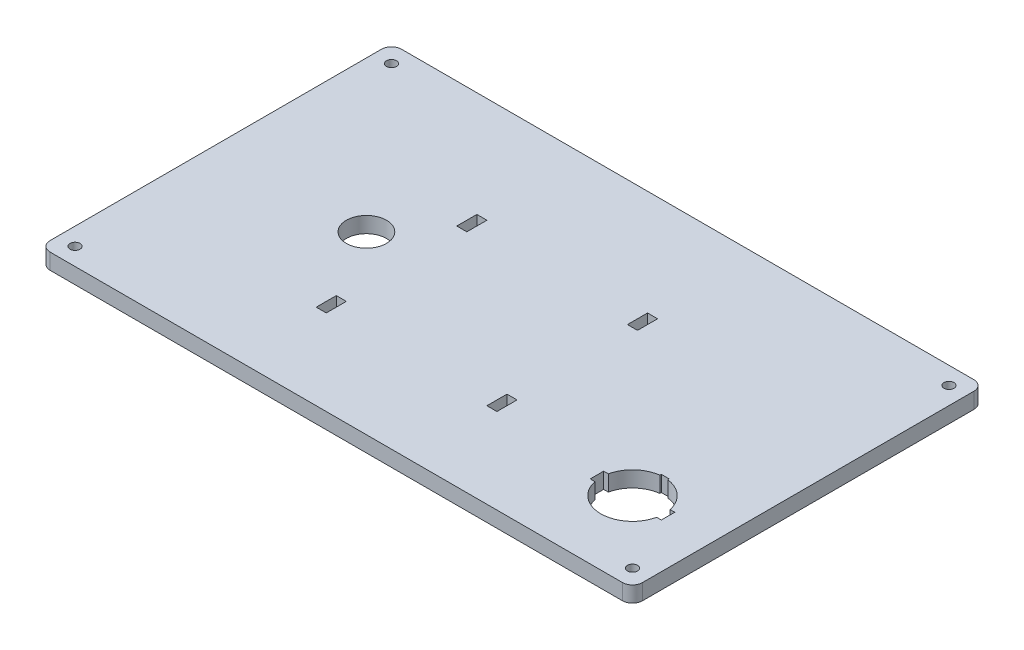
ISO-10303-21;
HEADER;
FILE_DESCRIPTION(('STEP AP214'),'2;1');
FILE_NAME('part.step','',(''),(''),'','','');
FILE_SCHEMA(('AUTOMOTIVE_DESIGN { 1 0 10303 214 1 1 1 1 }'));
ENDSEC;
DATA;
#1=APPLICATION_CONTEXT('core data for automotive mechanical design processes');
#2=APPLICATION_PROTOCOL_DEFINITION('international standard','automotive_design',2000,#1);
#3=PRODUCT_CONTEXT('',#1,'mechanical');
#4=PRODUCT('Part','Part','',(#3));
#5=PRODUCT_RELATED_PRODUCT_CATEGORY('part','',(#4));
#6=PRODUCT_DEFINITION_FORMATION('','',#4);
#7=PRODUCT_DEFINITION_CONTEXT('part definition',#1,'design');
#8=PRODUCT_DEFINITION('design','',#6,#7);
#9=PRODUCT_DEFINITION_SHAPE('','',#8);
#10=(LENGTH_UNIT() NAMED_UNIT(*) SI_UNIT(.MILLI.,.METRE.));
#11=(NAMED_UNIT(*) PLANE_ANGLE_UNIT() SI_UNIT($,.RADIAN.));
#12=(NAMED_UNIT(*) SI_UNIT($,.STERADIAN.) SOLID_ANGLE_UNIT());
#13=UNCERTAINTY_MEASURE_WITH_UNIT(LENGTH_MEASURE(1.E-05),#10,'distance_accuracy_value','');
#14=(GEOMETRIC_REPRESENTATION_CONTEXT(3) GLOBAL_UNCERTAINTY_ASSIGNED_CONTEXT((#13)) GLOBAL_UNIT_ASSIGNED_CONTEXT((#10,
#11,#12)) REPRESENTATION_CONTEXT('',''));
#15=CARTESIAN_POINT('',(0.,0.,0.));
#16=DIRECTION('',(0.,0.,1.));
#17=DIRECTION('',(1.,0.,0.));
#18=AXIS2_PLACEMENT_3D('',#15,#16,#17);
#19=CARTESIAN_POINT('',(-90.4875,5.,52.3875));
#20=DIRECTION('',(0.,1.,0.));
#21=DIRECTION('',(0.,0.,1.));
#22=AXIS2_PLACEMENT_3D('',#19,#20,#21);
#23=PLANE('',#22);
#24=CARTESIAN_POINT('',(-46.0375,5.,0.));
#25=DIRECTION('',(0.,1.,0.));
#26=DIRECTION('',(0.,0.,1.));
#27=AXIS2_PLACEMENT_3D('',#24,#25,#26);
#28=CIRCLE('',#27,6.35);
#29=CARTESIAN_POINT('',(-46.0375,5.,6.35));
#30=VERTEX_POINT('',#29);
#31=EDGE_CURVE('E753',#30,#30,#28,.T.);
#32=ORIENTED_EDGE('',*,*,#31,.F.);
#33=EDGE_LOOP('',(#32));
#34=FACE_BOUND('',#33,.T.);
#35=CARTESIAN_POINT('',(68.2625,5.,30.1625));
#36=DIRECTION('',(0.,1.,0.));
#37=DIRECTION('',(0.,0.,1.));
#38=AXIS2_PLACEMENT_3D('',#35,#36,#37);
#39=CIRCLE('',#38,9.99998);
#40=CARTESIAN_POINT('',(58.4908467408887,5.,32.28721));
#41=VERTEX_POINT('',#40);
#42=CARTESIAN_POINT('',(78.0341532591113,5.,32.28721));
#43=VERTEX_POINT('',#42);
#44=EDGE_CURVE('E48',#41,#43,#39,.T.);
#45=ORIENTED_EDGE('',*,*,#44,.F.);
#46=DIRECTION('',(1.,0.,0.));
#47=VECTOR('',#46,1.);
#48=CARTESIAN_POINT('',(58.4908467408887,5.,32.28721));
#49=LINE('',#48,#47);
#50=CARTESIAN_POINT('',(57.01284,5.,32.28721));
#51=VERTEX_POINT('',#50);
#52=EDGE_CURVE('E274',#51,#41,#49,.T.);
#53=ORIENTED_EDGE('',*,*,#52,.F.);
#54=DIRECTION('',(0.,0.,1.));
#55=VECTOR('',#54,1.);
#56=CARTESIAN_POINT('',(57.01284,5.,32.28721));
#57=LINE('',#56,#55);
#58=CARTESIAN_POINT('',(57.01284,5.,28.03779));
#59=VERTEX_POINT('',#58);
#60=EDGE_CURVE('E320',#59,#51,#57,.T.);
#61=ORIENTED_EDGE('',*,*,#60,.F.);
#62=DIRECTION('',(-1.,0.,0.));
#63=VECTOR('',#62,1.);
#64=CARTESIAN_POINT('',(57.01284,5.,28.03779));
#65=LINE('',#64,#63);
#66=CARTESIAN_POINT('',(58.4908467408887,5.,28.03779));
#67=VERTEX_POINT('',#66);
#68=EDGE_CURVE('E317',#67,#59,#65,.T.);
#69=ORIENTED_EDGE('',*,*,#68,.F.);
#70=CARTESIAN_POINT('',(68.2625,5.,30.1625));
#71=DIRECTION('',(0.,1.,0.));
#72=DIRECTION('',(0.,0.,1.));
#73=AXIS2_PLACEMENT_3D('',#70,#71,#72);
#74=CIRCLE('',#73,9.99998);
#75=CARTESIAN_POINT('',(67.01282,5.,20.2409124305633));
#76=VERTEX_POINT('',#75);
#77=EDGE_CURVE('E314',#76,#67,#74,.T.);
#78=ORIENTED_EDGE('',*,*,#77,.F.);
#79=DIRECTION('',(0.,0.,1.));
#80=VECTOR('',#79,1.);
#81=CARTESIAN_POINT('',(67.01282,5.,19.7866));
#82=LINE('',#81,#80);
#83=CARTESIAN_POINT('',(67.01282,5.,19.7866));
#84=VERTEX_POINT('',#83);
#85=EDGE_CURVE('E311',#84,#76,#82,.T.);
#86=ORIENTED_EDGE('',*,*,#85,.F.);
#87=DIRECTION('',(-1.,0.,0.));
#88=VECTOR('',#87,1.);
#89=CARTESIAN_POINT('',(69.51218,5.,19.7866));
#90=LINE('',#89,#88);
#91=CARTESIAN_POINT('',(69.51218,5.,19.7866));
#92=VERTEX_POINT('',#91);
#93=EDGE_CURVE('E308',#92,#84,#90,.T.);
#94=ORIENTED_EDGE('',*,*,#93,.F.);
#95=DIRECTION('',(0.,0.,-1.));
#96=VECTOR('',#95,1.);
#97=CARTESIAN_POINT('',(69.51218,5.,19.7866));
#98=LINE('',#97,#96);
#99=CARTESIAN_POINT('',(69.51218,5.,20.2409124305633));
#100=VERTEX_POINT('',#99);
#101=EDGE_CURVE('E305',#100,#92,#98,.T.);
#102=ORIENTED_EDGE('',*,*,#101,.F.);
#103=CARTESIAN_POINT('',(68.2625,5.,30.1625));
#104=DIRECTION('',(0.,1.,0.));
#105=DIRECTION('',(0.,0.,1.));
#106=AXIS2_PLACEMENT_3D('',#103,#104,#105);
#107=CIRCLE('',#106,9.99998);
#108=CARTESIAN_POINT('',(78.0341532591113,5.,28.03779));
#109=VERTEX_POINT('',#108);
#110=EDGE_CURVE('E302',#109,#100,#107,.T.);
#111=ORIENTED_EDGE('',*,*,#110,.F.);
#112=DIRECTION('',(-1.,0.,0.));
#113=VECTOR('',#112,1.);
#114=CARTESIAN_POINT('',(79.51216,5.,28.03779));
#115=LINE('',#114,#113);
#116=CARTESIAN_POINT('',(79.51216,5.,28.03779));
#117=VERTEX_POINT('',#116);
#118=EDGE_CURVE('E299',#117,#109,#115,.T.);
#119=ORIENTED_EDGE('',*,*,#118,.F.);
#120=DIRECTION('',(0.,0.,-1.));
#121=VECTOR('',#120,1.);
#122=CARTESIAN_POINT('',(79.51216,5.,32.28721));
#123=LINE('',#122,#121);
#124=CARTESIAN_POINT('',(79.51216,5.,32.28721));
#125=VERTEX_POINT('',#124);
#126=EDGE_CURVE('E296',#125,#117,#123,.T.);
#127=ORIENTED_EDGE('',*,*,#126,.F.);
#128=DIRECTION('',(1.,0.,0.));
#129=VECTOR('',#128,1.);
#130=CARTESIAN_POINT('',(78.0341532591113,5.,32.28721));
#131=LINE('',#130,#129);
#132=EDGE_CURVE('E289',#43,#125,#131,.T.);
#133=ORIENTED_EDGE('',*,*,#132,.F.);
#134=EDGE_LOOP('',(#45,#53,#61,#69,#78,#86,#94,#102,#111,#119,#127,#133));
#135=FACE_BOUND('',#134,.T.);
#136=DIRECTION('',(0.,0.,1.));
#137=VECTOR('',#136,1.);
#138=CARTESIAN_POINT('',(-33.3375,5.,22.225));
#139=LINE('',#138,#137);
#140=CARTESIAN_POINT('',(-33.3375,5.,22.225));
#141=VERTEX_POINT('',#140);
#142=CARTESIAN_POINT('',(-33.3375,5.,28.575));
#143=VERTEX_POINT('',#142);
#144=EDGE_CURVE('E352',#141,#143,#139,.T.);
#145=ORIENTED_EDGE('',*,*,#144,.F.);
#146=DIRECTION('',(-1.,0.,0.));
#147=VECTOR('',#146,1.);
#148=CARTESIAN_POINT('',(-33.3375,5.,22.225));
#149=LINE('',#148,#147);
#150=CARTESIAN_POINT('',(-30.1625,5.,22.225));
#151=VERTEX_POINT('',#150);
#152=EDGE_CURVE('E360',#151,#141,#149,.T.);
#153=ORIENTED_EDGE('',*,*,#152,.F.);
#154=DIRECTION('',(0.,0.,-1.));
#155=VECTOR('',#154,1.);
#156=CARTESIAN_POINT('',(-30.1625,5.,22.225));
#157=LINE('',#156,#155);
#158=CARTESIAN_POINT('',(-30.1625,5.,28.575));
#159=VERTEX_POINT('',#158);
#160=EDGE_CURVE('E357',#159,#151,#157,.T.);
#161=ORIENTED_EDGE('',*,*,#160,.F.);
#162=DIRECTION('',(1.,0.,0.));
#163=VECTOR('',#162,1.);
#164=CARTESIAN_POINT('',(-33.3375,5.,28.575));
#165=LINE('',#164,#163);
#166=EDGE_CURVE('E354',#143,#159,#165,.T.);
#167=ORIENTED_EDGE('',*,*,#166,.F.);
#168=EDGE_LOOP('',(#145,#153,#161,#167));
#169=FACE_BOUND('',#168,.T.);
#170=DIRECTION('',(0.,0.,1.));
#171=VECTOR('',#170,1.);
#172=CARTESIAN_POINT('',(-33.3375,5.,-22.225));
#173=LINE('',#172,#171);
#174=CARTESIAN_POINT('',(-33.3375,5.,-22.225));
#175=VERTEX_POINT('',#174);
#176=CARTESIAN_POINT('',(-33.3375,5.,-15.875));
#177=VERTEX_POINT('',#176);
#178=EDGE_CURVE('E383',#175,#177,#173,.T.);
#179=ORIENTED_EDGE('',*,*,#178,.F.);
#180=DIRECTION('',(-1.,0.,0.));
#181=VECTOR('',#180,1.);
#182=CARTESIAN_POINT('',(-33.3375,5.,-22.225));
#183=LINE('',#182,#181);
#184=CARTESIAN_POINT('',(-30.1625,5.,-22.225));
#185=VERTEX_POINT('',#184);
#186=EDGE_CURVE('E391',#185,#175,#183,.T.);
#187=ORIENTED_EDGE('',*,*,#186,.F.);
#188=DIRECTION('',(0.,0.,-1.));
#189=VECTOR('',#188,1.);
#190=CARTESIAN_POINT('',(-30.1625,5.,-22.225));
#191=LINE('',#190,#189);
#192=CARTESIAN_POINT('',(-30.1625,5.,-15.875));
#193=VERTEX_POINT('',#192);
#194=EDGE_CURVE('E388',#193,#185,#191,.T.);
#195=ORIENTED_EDGE('',*,*,#194,.F.);
#196=DIRECTION('',(1.,0.,0.));
#197=VECTOR('',#196,1.);
#198=CARTESIAN_POINT('',(-33.3375,5.,-15.875));
#199=LINE('',#198,#197);
#200=EDGE_CURVE('E385',#177,#193,#199,.T.);
#201=ORIENTED_EDGE('',*,*,#200,.F.);
#202=EDGE_LOOP('',(#179,#187,#195,#201));
#203=FACE_BOUND('',#202,.T.);
#204=DIRECTION('',(0.,0.,1.));
#205=VECTOR('',#204,1.);
#206=CARTESIAN_POINT('',(20.6375,5.,-22.225));
#207=LINE('',#206,#205);
#208=CARTESIAN_POINT('',(20.6375,5.,-22.225));
#209=VERTEX_POINT('',#208);
#210=CARTESIAN_POINT('',(20.6375,5.,-15.875));
#211=VERTEX_POINT('',#210);
#212=EDGE_CURVE('E414',#209,#211,#207,.T.);
#213=ORIENTED_EDGE('',*,*,#212,.F.);
#214=DIRECTION('',(-1.,0.,0.));
#215=VECTOR('',#214,1.);
#216=CARTESIAN_POINT('',(20.6375,5.,-22.225));
#217=LINE('',#216,#215);
#218=CARTESIAN_POINT('',(23.8125,5.,-22.225));
#219=VERTEX_POINT('',#218);
#220=EDGE_CURVE('E422',#219,#209,#217,.T.);
#221=ORIENTED_EDGE('',*,*,#220,.F.);
#222=DIRECTION('',(0.,0.,-1.));
#223=VECTOR('',#222,1.);
#224=CARTESIAN_POINT('',(23.8125,5.,-22.225));
#225=LINE('',#224,#223);
#226=CARTESIAN_POINT('',(23.8125,5.,-15.875));
#227=VERTEX_POINT('',#226);
#228=EDGE_CURVE('E419',#227,#219,#225,.T.);
#229=ORIENTED_EDGE('',*,*,#228,.F.);
#230=DIRECTION('',(1.,0.,0.));
#231=VECTOR('',#230,1.);
#232=CARTESIAN_POINT('',(20.6375,5.,-15.875));
#233=LINE('',#232,#231);
#234=EDGE_CURVE('E416',#211,#227,#233,.T.);
#235=ORIENTED_EDGE('',*,*,#234,.F.);
#236=EDGE_LOOP('',(#213,#221,#229,#235));
#237=FACE_BOUND('',#236,.T.);
#238=DIRECTION('',(0.,0.,1.));
#239=VECTOR('',#238,1.);
#240=CARTESIAN_POINT('',(20.6375,5.,22.225));
#241=LINE('',#240,#239);
#242=CARTESIAN_POINT('',(20.6375,5.,22.225));
#243=VERTEX_POINT('',#242);
#244=CARTESIAN_POINT('',(20.6375,5.,28.575));
#245=VERTEX_POINT('',#244);
#246=EDGE_CURVE('E445',#243,#245,#241,.T.);
#247=ORIENTED_EDGE('',*,*,#246,.F.);
#248=DIRECTION('',(-1.,0.,0.));
#249=VECTOR('',#248,1.);
#250=CARTESIAN_POINT('',(20.6375,5.,22.225));
#251=LINE('',#250,#249);
#252=CARTESIAN_POINT('',(23.8125,5.,22.225));
#253=VERTEX_POINT('',#252);
#254=EDGE_CURVE('E453',#253,#243,#251,.T.);
#255=ORIENTED_EDGE('',*,*,#254,.F.);
#256=DIRECTION('',(0.,0.,-1.));
#257=VECTOR('',#256,1.);
#258=CARTESIAN_POINT('',(23.8125,5.,22.225));
#259=LINE('',#258,#257);
#260=CARTESIAN_POINT('',(23.8125,5.,28.575));
#261=VERTEX_POINT('',#260);
#262=EDGE_CURVE('E450',#261,#253,#259,.T.);
#263=ORIENTED_EDGE('',*,*,#262,.F.);
#264=DIRECTION('',(1.,0.,0.));
#265=VECTOR('',#264,1.);
#266=CARTESIAN_POINT('',(20.6375,5.,28.575));
#267=LINE('',#266,#265);
#268=EDGE_CURVE('E447',#245,#261,#267,.T.);
#269=ORIENTED_EDGE('',*,*,#268,.F.);
#270=EDGE_LOOP('',(#247,#255,#263,#269));
#271=FACE_BOUND('',#270,.T.);
#272=CARTESIAN_POINT('',(88.138,5.,50.038));
#273=DIRECTION('',(0.,1.,0.));
#274=DIRECTION('',(0.,0.,1.));
#275=AXIS2_PLACEMENT_3D('',#272,#273,#274);
#276=CIRCLE('',#275,1.5875);
#277=CARTESIAN_POINT('',(88.138,5.,51.6255));
#278=VERTEX_POINT('',#277);
#279=EDGE_CURVE('E475',#278,#278,#276,.T.);
#280=ORIENTED_EDGE('',*,*,#279,.F.);
#281=EDGE_LOOP('',(#280));
#282=FACE_BOUND('',#281,.T.);
#283=CARTESIAN_POINT('',(-88.138,5.,-50.038));
#284=DIRECTION('',(0.,1.,0.));
#285=DIRECTION('',(0.,0.,1.));
#286=AXIS2_PLACEMENT_3D('',#283,#284,#285);
#287=CIRCLE('',#286,1.5875);
#288=CARTESIAN_POINT('',(-88.138,5.,-48.4505));
#289=VERTEX_POINT('',#288);
#290=EDGE_CURVE('E487',#289,#289,#287,.T.);
#291=ORIENTED_EDGE('',*,*,#290,.F.);
#292=EDGE_LOOP('',(#291));
#293=FACE_BOUND('',#292,.T.);
#294=CARTESIAN_POINT('',(-90.4875,5.,52.3875));
#295=DIRECTION('',(0.,1.,0.));
#296=DIRECTION('',(0.,0.,1.));
#297=AXIS2_PLACEMENT_3D('',#294,#295,#296);
#298=CIRCLE('',#297,3.175);
#299=CARTESIAN_POINT('',(-93.6625,5.,52.3875));
#300=VERTEX_POINT('',#299);
#301=CARTESIAN_POINT('',(-90.4875,5.,55.5625));
#302=VERTEX_POINT('',#301);
#303=EDGE_CURVE('E493',#300,#302,#298,.T.);
#304=ORIENTED_EDGE('',*,*,#303,.T.);
#305=DIRECTION('',(1.,0.,0.));
#306=VECTOR('',#305,1.);
#307=CARTESIAN_POINT('',(-90.4875,5.,55.5625));
#308=LINE('',#307,#306);
#309=CARTESIAN_POINT('',(90.4875,5.,55.5625));
#310=VERTEX_POINT('',#309);
#311=EDGE_CURVE('E496',#302,#310,#308,.T.);
#312=ORIENTED_EDGE('',*,*,#311,.T.);
#313=CARTESIAN_POINT('',(90.4875,5.,52.3875));
#314=DIRECTION('',(0.,1.,0.));
#315=DIRECTION('',(0.,0.,1.));
#316=AXIS2_PLACEMENT_3D('',#313,#314,#315);
#317=CIRCLE('',#316,3.175);
#318=CARTESIAN_POINT('',(93.6625,5.,52.3875));
#319=VERTEX_POINT('',#318);
#320=EDGE_CURVE('E499',#310,#319,#317,.T.);
#321=ORIENTED_EDGE('',*,*,#320,.T.);
#322=DIRECTION('',(0.,0.,-1.));
#323=VECTOR('',#322,1.);
#324=CARTESIAN_POINT('',(93.6625,5.,-52.3875));
#325=LINE('',#324,#323);
#326=CARTESIAN_POINT('',(93.6625,5.,-52.3875));
#327=VERTEX_POINT('',#326);
#328=EDGE_CURVE('E501',#319,#327,#325,.T.);
#329=ORIENTED_EDGE('',*,*,#328,.T.);
#330=CARTESIAN_POINT('',(90.4875,5.,-52.3875));
#331=DIRECTION('',(0.,1.,0.));
#332=DIRECTION('',(0.,0.,-1.));
#333=AXIS2_PLACEMENT_3D('',#330,#331,#332);
#334=CIRCLE('',#333,3.175);
#335=CARTESIAN_POINT('',(90.4874999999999,5.,-55.5625));
#336=VERTEX_POINT('',#335);
#337=EDGE_CURVE('E503',#327,#336,#334,.T.);
#338=ORIENTED_EDGE('',*,*,#337,.T.);
#339=DIRECTION('',(-1.,0.,0.));
#340=VECTOR('',#339,1.);
#341=CARTESIAN_POINT('',(-90.4875,5.,-55.5625));
#342=LINE('',#341,#340);
#343=CARTESIAN_POINT('',(-90.4875,5.,-55.5625));
#344=VERTEX_POINT('',#343);
#345=EDGE_CURVE('E505',#336,#344,#342,.T.);
#346=ORIENTED_EDGE('',*,*,#345,.T.);
#347=CARTESIAN_POINT('',(-90.4875,5.,-52.3875));
#348=DIRECTION('',(0.,1.,0.));
#349=DIRECTION('',(0.,0.,1.));
#350=AXIS2_PLACEMENT_3D('',#347,#348,#349);
#351=CIRCLE('',#350,3.175);
#352=CARTESIAN_POINT('',(-93.6625,5.,-52.3875));
#353=VERTEX_POINT('',#352);
#354=EDGE_CURVE('E507',#344,#353,#351,.T.);
#355=ORIENTED_EDGE('',*,*,#354,.T.);
#356=DIRECTION('',(0.,0.,1.));
#357=VECTOR('',#356,1.);
#358=CARTESIAN_POINT('',(-93.6625,5.,-52.3875));
#359=LINE('',#358,#357);
#360=EDGE_CURVE('E509',#353,#300,#359,.T.);
#361=ORIENTED_EDGE('',*,*,#360,.T.);
#362=EDGE_LOOP('',(#304,#312,#321,#329,#338,#346,#355,#361));
#363=FACE_BOUND('',#362,.T.);
#364=CARTESIAN_POINT('',(-88.138,5.,50.038));
#365=DIRECTION('',(0.,1.,0.));
#366=DIRECTION('',(0.,0.,1.));
#367=AXIS2_PLACEMENT_3D('',#364,#365,#366);
#368=CIRCLE('',#367,1.5875);
#369=CARTESIAN_POINT('',(-88.138,5.,51.6255));
#370=VERTEX_POINT('',#369);
#371=EDGE_CURVE('E481',#370,#370,#368,.T.);
#372=ORIENTED_EDGE('',*,*,#371,.F.);
#373=EDGE_LOOP('',(#372));
#374=FACE_BOUND('',#373,.T.);
#375=CARTESIAN_POINT('',(88.138,5.,-50.038));
#376=DIRECTION('',(0.,1.,0.));
#377=DIRECTION('',(0.,0.,1.));
#378=AXIS2_PLACEMENT_3D('',#375,#376,#377);
#379=CIRCLE('',#378,1.5875);
#380=CARTESIAN_POINT('',(88.138,5.,-48.4505));
#381=VERTEX_POINT('',#380);
#382=EDGE_CURVE('E469',#381,#381,#379,.T.);
#383=ORIENTED_EDGE('',*,*,#382,.F.);
#384=EDGE_LOOP('',(#383));
#385=FACE_BOUND('',#384,.T.);
#386=ADVANCED_FACE('F33',(#34,#135,#169,#203,#237,#271,#282,#293,#363,#374,#385),#23,.T.);
#387=CARTESIAN_POINT('',(-90.4875,0.,52.3875));
#388=DIRECTION('',(0.,1.,0.));
#389=DIRECTION('',(0.,0.,1.));
#390=AXIS2_PLACEMENT_3D('',#387,#388,#389);
#391=PLANE('',#390);
#392=CARTESIAN_POINT('',(-46.0375,0.,0.));
#393=DIRECTION('',(0.,1.,0.));
#394=DIRECTION('',(0.,0.,1.));
#395=AXIS2_PLACEMENT_3D('',#392,#393,#394);
#396=CIRCLE('',#395,6.35);
#397=CARTESIAN_POINT('',(-46.0375,0.,6.35));
#398=VERTEX_POINT('',#397);
#399=EDGE_CURVE('E756',#398,#398,#396,.F.);
#400=ORIENTED_EDGE('',*,*,#399,.F.);
#401=EDGE_LOOP('',(#400));
#402=FACE_BOUND('',#401,.T.);
#403=DIRECTION('',(-1.,0.,0.));
#404=VECTOR('',#403,1.);
#405=CARTESIAN_POINT('',(58.4908467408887,0.,32.28721));
#406=LINE('',#405,#404);
#407=CARTESIAN_POINT('',(58.4908467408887,0.,32.28721));
#408=VERTEX_POINT('',#407);
#409=CARTESIAN_POINT('',(57.01284,0.,32.28721));
#410=VERTEX_POINT('',#409);
#411=EDGE_CURVE('E287',#408,#410,#406,.T.);
#412=ORIENTED_EDGE('',*,*,#411,.F.);
#413=CARTESIAN_POINT('',(68.2625,0.,30.1625));
#414=DIRECTION('',(0.,1.,0.));
#415=DIRECTION('',(0.,0.,1.));
#416=AXIS2_PLACEMENT_3D('',#413,#414,#415);
#417=CIRCLE('',#416,9.99998);
#418=CARTESIAN_POINT('',(78.0341532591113,0.,32.28721));
#419=VERTEX_POINT('',#418);
#420=EDGE_CURVE('E268',#419,#408,#417,.F.);
#421=ORIENTED_EDGE('',*,*,#420,.F.);
#422=DIRECTION('',(-1.,0.,0.));
#423=VECTOR('',#422,1.);
#424=CARTESIAN_POINT('',(78.0341532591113,0.,32.28721));
#425=LINE('',#424,#423);
#426=CARTESIAN_POINT('',(79.51216,0.,32.28721));
#427=VERTEX_POINT('',#426);
#428=EDGE_CURVE('E277',#427,#419,#425,.T.);
#429=ORIENTED_EDGE('',*,*,#428,.F.);
#430=DIRECTION('',(0.,0.,1.));
#431=VECTOR('',#430,1.);
#432=CARTESIAN_POINT('',(79.51216,0.,32.28721));
#433=LINE('',#432,#431);
#434=CARTESIAN_POINT('',(79.51216,0.,28.03779));
#435=VERTEX_POINT('',#434);
#436=EDGE_CURVE('E56',#435,#427,#433,.T.);
#437=ORIENTED_EDGE('',*,*,#436,.F.);
#438=DIRECTION('',(1.,0.,0.));
#439=VECTOR('',#438,1.);
#440=CARTESIAN_POINT('',(79.51216,0.,28.03779));
#441=LINE('',#440,#439);
#442=CARTESIAN_POINT('',(78.0341532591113,0.,28.03779));
#443=VERTEX_POINT('',#442);
#444=EDGE_CURVE('E758',#443,#435,#441,.T.);
#445=ORIENTED_EDGE('',*,*,#444,.F.);
#446=CARTESIAN_POINT('',(68.2625,0.,30.1625));
#447=DIRECTION('',(0.,1.,0.));
#448=DIRECTION('',(0.,0.,1.));
#449=AXIS2_PLACEMENT_3D('',#446,#447,#448);
#450=CIRCLE('',#449,9.99998);
#451=CARTESIAN_POINT('',(69.51218,0.,20.2409124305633));
#452=VERTEX_POINT('',#451);
#453=EDGE_CURVE('E764',#452,#443,#450,.F.);
#454=ORIENTED_EDGE('',*,*,#453,.F.);
#455=DIRECTION('',(0.,0.,1.));
#456=VECTOR('',#455,1.);
#457=CARTESIAN_POINT('',(69.51218,0.,19.7866));
#458=LINE('',#457,#456);
#459=CARTESIAN_POINT('',(69.51218,0.,19.7866));
#460=VERTEX_POINT('',#459);
#461=EDGE_CURVE('E767',#460,#452,#458,.T.);
#462=ORIENTED_EDGE('',*,*,#461,.F.);
#463=DIRECTION('',(1.,0.,0.));
#464=VECTOR('',#463,1.);
#465=CARTESIAN_POINT('',(69.51218,0.,19.7866));
#466=LINE('',#465,#464);
#467=CARTESIAN_POINT('',(67.01282,0.,19.7866));
#468=VERTEX_POINT('',#467);
#469=EDGE_CURVE('E770',#468,#460,#466,.T.);
#470=ORIENTED_EDGE('',*,*,#469,.F.);
#471=DIRECTION('',(0.,0.,-1.));
#472=VECTOR('',#471,1.);
#473=CARTESIAN_POINT('',(67.01282,0.,19.7866));
#474=LINE('',#473,#472);
#475=CARTESIAN_POINT('',(67.01282,0.,20.2409124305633));
#476=VERTEX_POINT('',#475);
#477=EDGE_CURVE('E773',#476,#468,#474,.T.);
#478=ORIENTED_EDGE('',*,*,#477,.F.);
#479=CARTESIAN_POINT('',(68.2625,0.,30.1625));
#480=DIRECTION('',(0.,1.,0.));
#481=DIRECTION('',(0.,0.,1.));
#482=AXIS2_PLACEMENT_3D('',#479,#480,#481);
#483=CIRCLE('',#482,9.99998);
#484=CARTESIAN_POINT('',(58.4908467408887,0.,28.03779));
#485=VERTEX_POINT('',#484);
#486=EDGE_CURVE('E776',#485,#476,#483,.F.);
#487=ORIENTED_EDGE('',*,*,#486,.F.);
#488=DIRECTION('',(1.,0.,0.));
#489=VECTOR('',#488,1.);
#490=CARTESIAN_POINT('',(57.01284,0.,28.03779));
#491=LINE('',#490,#489);
#492=CARTESIAN_POINT('',(57.01284,0.,28.03779));
#493=VERTEX_POINT('',#492);
#494=EDGE_CURVE('E779',#493,#485,#491,.T.);
#495=ORIENTED_EDGE('',*,*,#494,.F.);
#496=DIRECTION('',(0.,0.,-1.));
#497=VECTOR('',#496,1.);
#498=CARTESIAN_POINT('',(57.01284,0.,32.28721));
#499=LINE('',#498,#497);
#500=EDGE_CURVE('E291',#410,#493,#499,.T.);
#501=ORIENTED_EDGE('',*,*,#500,.F.);
#502=EDGE_LOOP('',(#412,#421,#429,#437,#445,#454,#462,#470,#478,#487,#495,#501));
#503=FACE_BOUND('',#502,.T.);
#504=DIRECTION('',(1.,0.,0.));
#505=VECTOR('',#504,1.);
#506=CARTESIAN_POINT('',(-33.3375,0.,22.225));
#507=LINE('',#506,#505);
#508=CARTESIAN_POINT('',(-33.3375,0.,22.225));
#509=VERTEX_POINT('',#508);
#510=CARTESIAN_POINT('',(-30.1625,0.,22.225));
#511=VERTEX_POINT('',#510);
#512=EDGE_CURVE('E346',#509,#511,#507,.T.);
#513=ORIENTED_EDGE('',*,*,#512,.F.);
#514=DIRECTION('',(0.,0.,-1.));
#515=VECTOR('',#514,1.);
#516=CARTESIAN_POINT('',(-33.3375,0.,22.225));
#517=LINE('',#516,#515);
#518=CARTESIAN_POINT('',(-33.3375,0.,28.575));
#519=VERTEX_POINT('',#518);
#520=EDGE_CURVE('E349',#519,#509,#517,.T.);
#521=ORIENTED_EDGE('',*,*,#520,.F.);
#522=DIRECTION('',(-1.,0.,0.));
#523=VECTOR('',#522,1.);
#524=CARTESIAN_POINT('',(-33.3375,0.,28.575));
#525=LINE('',#524,#523);
#526=CARTESIAN_POINT('',(-30.1625,0.,28.575));
#527=VERTEX_POINT('',#526);
#528=EDGE_CURVE('E366',#527,#519,#525,.T.);
#529=ORIENTED_EDGE('',*,*,#528,.F.);
#530=DIRECTION('',(0.,0.,1.));
#531=VECTOR('',#530,1.);
#532=CARTESIAN_POINT('',(-30.1625,0.,22.225));
#533=LINE('',#532,#531);
#534=EDGE_CURVE('E280',#511,#527,#533,.T.);
#535=ORIENTED_EDGE('',*,*,#534,.F.);
#536=EDGE_LOOP('',(#513,#521,#529,#535));
#537=FACE_BOUND('',#536,.T.);
#538=DIRECTION('',(1.,0.,0.));
#539=VECTOR('',#538,1.);
#540=CARTESIAN_POINT('',(-33.3375,0.,-22.225));
#541=LINE('',#540,#539);
#542=CARTESIAN_POINT('',(-33.3375,0.,-22.225));
#543=VERTEX_POINT('',#542);
#544=CARTESIAN_POINT('',(-30.1625,0.,-22.225));
#545=VERTEX_POINT('',#544);
#546=EDGE_CURVE('E377',#543,#545,#541,.T.);
#547=ORIENTED_EDGE('',*,*,#546,.F.);
#548=DIRECTION('',(0.,0.,-1.));
#549=VECTOR('',#548,1.);
#550=CARTESIAN_POINT('',(-33.3375,0.,-22.225));
#551=LINE('',#550,#549);
#552=CARTESIAN_POINT('',(-33.3375,0.,-15.875));
#553=VERTEX_POINT('',#552);
#554=EDGE_CURVE('E380',#553,#543,#551,.T.);
#555=ORIENTED_EDGE('',*,*,#554,.F.);
#556=DIRECTION('',(-1.,0.,0.));
#557=VECTOR('',#556,1.);
#558=CARTESIAN_POINT('',(-33.3375,0.,-15.875));
#559=LINE('',#558,#557);
#560=CARTESIAN_POINT('',(-30.1625,0.,-15.875));
#561=VERTEX_POINT('',#560);
#562=EDGE_CURVE('E397',#561,#553,#559,.T.);
#563=ORIENTED_EDGE('',*,*,#562,.F.);
#564=DIRECTION('',(0.,0.,1.));
#565=VECTOR('',#564,1.);
#566=CARTESIAN_POINT('',(-30.1625,0.,-22.225));
#567=LINE('',#566,#565);
#568=EDGE_CURVE('E375',#545,#561,#567,.T.);
#569=ORIENTED_EDGE('',*,*,#568,.F.);
#570=EDGE_LOOP('',(#547,#555,#563,#569));
#571=FACE_BOUND('',#570,.T.);
#572=DIRECTION('',(1.,0.,0.));
#573=VECTOR('',#572,1.);
#574=CARTESIAN_POINT('',(20.6375,0.,-22.225));
#575=LINE('',#574,#573);
#576=CARTESIAN_POINT('',(20.6375,0.,-22.225));
#577=VERTEX_POINT('',#576);
#578=CARTESIAN_POINT('',(23.8125,0.,-22.225));
#579=VERTEX_POINT('',#578);
#580=EDGE_CURVE('E408',#577,#579,#575,.T.);
#581=ORIENTED_EDGE('',*,*,#580,.F.);
#582=DIRECTION('',(0.,0.,-1.));
#583=VECTOR('',#582,1.);
#584=CARTESIAN_POINT('',(20.6375,0.,-22.225));
#585=LINE('',#584,#583);
#586=CARTESIAN_POINT('',(20.6375,0.,-15.875));
#587=VERTEX_POINT('',#586);
#588=EDGE_CURVE('E411',#587,#577,#585,.T.);
#589=ORIENTED_EDGE('',*,*,#588,.F.);
#590=DIRECTION('',(-1.,0.,0.));
#591=VECTOR('',#590,1.);
#592=CARTESIAN_POINT('',(20.6375,0.,-15.875));
#593=LINE('',#592,#591);
#594=CARTESIAN_POINT('',(23.8125,0.,-15.875));
#595=VERTEX_POINT('',#594);
#596=EDGE_CURVE('E428',#595,#587,#593,.T.);
#597=ORIENTED_EDGE('',*,*,#596,.F.);
#598=DIRECTION('',(0.,0.,1.));
#599=VECTOR('',#598,1.);
#600=CARTESIAN_POINT('',(23.8125,0.,-22.225));
#601=LINE('',#600,#599);
#602=EDGE_CURVE('E406',#579,#595,#601,.T.);
#603=ORIENTED_EDGE('',*,*,#602,.F.);
#604=EDGE_LOOP('',(#581,#589,#597,#603));
#605=FACE_BOUND('',#604,.T.);
#606=DIRECTION('',(1.,0.,0.));
#607=VECTOR('',#606,1.);
#608=CARTESIAN_POINT('',(20.6375,0.,22.225));
#609=LINE('',#608,#607);
#610=CARTESIAN_POINT('',(20.6375,0.,22.225));
#611=VERTEX_POINT('',#610);
#612=CARTESIAN_POINT('',(23.8125,0.,22.225));
#613=VERTEX_POINT('',#612);
#614=EDGE_CURVE('E439',#611,#613,#609,.T.);
#615=ORIENTED_EDGE('',*,*,#614,.F.);
#616=DIRECTION('',(0.,0.,-1.));
#617=VECTOR('',#616,1.);
#618=CARTESIAN_POINT('',(20.6375,0.,22.225));
#619=LINE('',#618,#617);
#620=CARTESIAN_POINT('',(20.6375,0.,28.575));
#621=VERTEX_POINT('',#620);
#622=EDGE_CURVE('E442',#621,#611,#619,.T.);
#623=ORIENTED_EDGE('',*,*,#622,.F.);
#624=DIRECTION('',(-1.,0.,0.));
#625=VECTOR('',#624,1.);
#626=CARTESIAN_POINT('',(20.6375,0.,28.575));
#627=LINE('',#626,#625);
#628=CARTESIAN_POINT('',(23.8125,0.,28.575));
#629=VERTEX_POINT('',#628);
#630=EDGE_CURVE('E459',#629,#621,#627,.T.);
#631=ORIENTED_EDGE('',*,*,#630,.F.);
#632=DIRECTION('',(0.,0.,1.));
#633=VECTOR('',#632,1.);
#634=CARTESIAN_POINT('',(23.8125,0.,22.225));
#635=LINE('',#634,#633);
#636=EDGE_CURVE('E437',#613,#629,#635,.T.);
#637=ORIENTED_EDGE('',*,*,#636,.F.);
#638=EDGE_LOOP('',(#615,#623,#631,#637));
#639=FACE_BOUND('',#638,.T.);
#640=CARTESIAN_POINT('',(-90.4875,0.,52.3875));
#641=DIRECTION('',(0.,1.,0.));
#642=DIRECTION('',(0.,0.,1.));
#643=AXIS2_PLACEMENT_3D('',#640,#641,#642);
#644=CIRCLE('',#643,3.175);
#645=CARTESIAN_POINT('',(-93.6625,0.,52.3875));
#646=VERTEX_POINT('',#645);
#647=CARTESIAN_POINT('',(-90.4875,0.,55.5625));
#648=VERTEX_POINT('',#647);
#649=EDGE_CURVE('E490',#646,#648,#644,.T.);
#650=ORIENTED_EDGE('',*,*,#649,.F.);
#651=DIRECTION('',(0.,0.,1.));
#652=VECTOR('',#651,1.);
#653=CARTESIAN_POINT('',(-93.6625,0.,-52.3875));
#654=LINE('',#653,#652);
#655=CARTESIAN_POINT('',(-93.6625,0.,-52.3875));
#656=VERTEX_POINT('',#655);
#657=EDGE_CURVE('E497',#656,#646,#654,.T.);
#658=ORIENTED_EDGE('',*,*,#657,.F.);
#659=CARTESIAN_POINT('',(-90.4875,0.,-52.3875));
#660=DIRECTION('',(0.,1.,0.));
#661=DIRECTION('',(0.,0.,1.));
#662=AXIS2_PLACEMENT_3D('',#659,#660,#661);
#663=CIRCLE('',#662,3.175);
#664=CARTESIAN_POINT('',(-90.4875,0.,-55.5625));
#665=VERTEX_POINT('',#664);
#666=EDGE_CURVE('E524',#665,#656,#663,.T.);
#667=ORIENTED_EDGE('',*,*,#666,.F.);
#668=DIRECTION('',(-1.,0.,0.));
#669=VECTOR('',#668,1.);
#670=CARTESIAN_POINT('',(-90.4875,0.,-55.5625));
#671=LINE('',#670,#669);
#672=CARTESIAN_POINT('',(90.4874999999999,0.,-55.5625));
#673=VERTEX_POINT('',#672);
#674=EDGE_CURVE('E522',#673,#665,#671,.T.);
#675=ORIENTED_EDGE('',*,*,#674,.F.);
#676=CARTESIAN_POINT('',(90.4875,0.,-52.3875));
#677=DIRECTION('',(0.,1.,0.));
#678=DIRECTION('',(0.,0.,-1.));
#679=AXIS2_PLACEMENT_3D('',#676,#677,#678);
#680=CIRCLE('',#679,3.175);
#681=CARTESIAN_POINT('',(93.6625,0.,-52.3875));
#682=VERTEX_POINT('',#681);
#683=EDGE_CURVE('E520',#682,#673,#680,.T.);
#684=ORIENTED_EDGE('',*,*,#683,.F.);
#685=DIRECTION('',(0.,0.,-1.));
#686=VECTOR('',#685,1.);
#687=CARTESIAN_POINT('',(93.6625,0.,-52.3875));
#688=LINE('',#687,#686);
#689=CARTESIAN_POINT('',(93.6625,0.,52.3875));
#690=VERTEX_POINT('',#689);
#691=EDGE_CURVE('E518',#690,#682,#688,.T.);
#692=ORIENTED_EDGE('',*,*,#691,.F.);
#693=CARTESIAN_POINT('',(90.4875,0.,52.3875));
#694=DIRECTION('',(0.,1.,0.));
#695=DIRECTION('',(0.,0.,1.));
#696=AXIS2_PLACEMENT_3D('',#693,#694,#695);
#697=CIRCLE('',#696,3.175);
#698=CARTESIAN_POINT('',(90.4875,0.,55.5625));
#699=VERTEX_POINT('',#698);
#700=EDGE_CURVE('E516',#699,#690,#697,.T.);
#701=ORIENTED_EDGE('',*,*,#700,.F.);
#702=DIRECTION('',(1.,0.,0.));
#703=VECTOR('',#702,1.);
#704=CARTESIAN_POINT('',(-90.4875,0.,55.5625));
#705=LINE('',#704,#703);
#706=EDGE_CURVE('E514',#648,#699,#705,.T.);
#707=ORIENTED_EDGE('',*,*,#706,.F.);
#708=EDGE_LOOP('',(#650,#658,#667,#675,#684,#692,#701,#707));
#709=FACE_BOUND('',#708,.T.);
#710=CARTESIAN_POINT('',(-88.138,0.,-50.038));
#711=DIRECTION('',(0.,1.,0.));
#712=DIRECTION('',(0.,0.,1.));
#713=AXIS2_PLACEMENT_3D('',#710,#711,#712);
#714=CIRCLE('',#713,1.5875);
#715=CARTESIAN_POINT('',(-88.138,0.,-48.4505));
#716=VERTEX_POINT('',#715);
#717=EDGE_CURVE('E484',#716,#716,#714,.T.);
#718=ORIENTED_EDGE('',*,*,#717,.T.);
#719=EDGE_LOOP('',(#718));
#720=FACE_BOUND('',#719,.T.);
#721=CARTESIAN_POINT('',(-88.138,0.,50.038));
#722=DIRECTION('',(0.,1.,0.));
#723=DIRECTION('',(0.,0.,1.));
#724=AXIS2_PLACEMENT_3D('',#721,#722,#723);
#725=CIRCLE('',#724,1.5875);
#726=CARTESIAN_POINT('',(-88.138,0.,51.6255));
#727=VERTEX_POINT('',#726);
#728=EDGE_CURVE('E478',#727,#727,#725,.T.);
#729=ORIENTED_EDGE('',*,*,#728,.T.);
#730=EDGE_LOOP('',(#729));
#731=FACE_BOUND('',#730,.T.);
#732=CARTESIAN_POINT('',(88.138,0.,50.038));
#733=DIRECTION('',(0.,1.,0.));
#734=DIRECTION('',(0.,0.,1.));
#735=AXIS2_PLACEMENT_3D('',#732,#733,#734);
#736=CIRCLE('',#735,1.5875);
#737=CARTESIAN_POINT('',(88.138,0.,51.6255));
#738=VERTEX_POINT('',#737);
#739=EDGE_CURVE('E472',#738,#738,#736,.T.);
#740=ORIENTED_EDGE('',*,*,#739,.T.);
#741=EDGE_LOOP('',(#740));
#742=FACE_BOUND('',#741,.T.);
#743=CARTESIAN_POINT('',(88.138,0.,-50.038));
#744=DIRECTION('',(0.,1.,0.));
#745=DIRECTION('',(0.,0.,1.));
#746=AXIS2_PLACEMENT_3D('',#743,#744,#745);
#747=CIRCLE('',#746,1.5875);
#748=CARTESIAN_POINT('',(88.138,0.,-48.4505));
#749=VERTEX_POINT('',#748);
#750=EDGE_CURVE('E468',#749,#749,#747,.T.);
#751=ORIENTED_EDGE('',*,*,#750,.T.);
#752=EDGE_LOOP('',(#751));
#753=FACE_BOUND('',#752,.T.);
#754=ADVANCED_FACE('F283',(#402,#503,#537,#571,#605,#639,#709,#720,#731,#742,#753),#391,.F.);
#755=CARTESIAN_POINT('',(-90.4875,5.,52.3875));
#756=DIRECTION('',(0.,-1.,0.));
#757=DIRECTION('',(0.,0.,-1.));
#758=AXIS2_PLACEMENT_3D('',#755,#756,#757);
#759=CYLINDRICAL_SURFACE('',#758,3.175);
#760=ORIENTED_EDGE('',*,*,#649,.T.);
#761=DIRECTION('',(0.,-1.,0.));
#762=VECTOR('',#761,1.);
#763=CARTESIAN_POINT('',(-90.4875,5.,55.5625));
#764=LINE('',#763,#762);
#765=EDGE_CURVE('E11',#302,#648,#764,.T.);
#766=ORIENTED_EDGE('',*,*,#765,.F.);
#767=ORIENTED_EDGE('',*,*,#303,.F.);
#768=DIRECTION('',(0.,-1.,0.));
#769=VECTOR('',#768,1.);
#770=CARTESIAN_POINT('',(-93.6625,5.,52.3875));
#771=LINE('',#770,#769);
#772=EDGE_CURVE('E511',#300,#646,#771,.T.);
#773=ORIENTED_EDGE('',*,*,#772,.T.);
#774=EDGE_LOOP('',(#760,#766,#767,#773));
#775=FACE_BOUND('',#774,.T.);
#776=ADVANCED_FACE('F35',(#775),#759,.T.);
#777=CARTESIAN_POINT('',(-90.4875,5.,55.5625));
#778=DIRECTION('',(0.,0.,-1.));
#779=DIRECTION('',(-1.,0.,0.));
#780=AXIS2_PLACEMENT_3D('',#777,#778,#779);
#781=PLANE('',#780);
#782=ORIENTED_EDGE('',*,*,#706,.T.);
#783=DIRECTION('',(0.,-1.,0.));
#784=VECTOR('',#783,1.);
#785=CARTESIAN_POINT('',(90.4875,5.,55.5625));
#786=LINE('',#785,#784);
#787=EDGE_CURVE('E41',#310,#699,#786,.T.);
#788=ORIENTED_EDGE('',*,*,#787,.F.);
#789=ORIENTED_EDGE('',*,*,#311,.F.);
#790=ORIENTED_EDGE('',*,*,#765,.T.);
#791=EDGE_LOOP('',(#782,#788,#789,#790));
#792=FACE_BOUND('',#791,.T.);
#793=ADVANCED_FACE('F571',(#792),#781,.F.);
#794=CARTESIAN_POINT('',(90.4875,5.,52.3875));
#795=DIRECTION('',(0.,-1.,0.));
#796=DIRECTION('',(0.,0.,-1.));
#797=AXIS2_PLACEMENT_3D('',#794,#795,#796);
#798=CYLINDRICAL_SURFACE('',#797,3.175);
#799=ORIENTED_EDGE('',*,*,#700,.T.);
#800=DIRECTION('',(0.,-1.,0.));
#801=VECTOR('',#800,1.);
#802=CARTESIAN_POINT('',(93.6625,5.,52.3875));
#803=LINE('',#802,#801);
#804=EDGE_CURVE('E541',#319,#690,#803,.T.);
#805=ORIENTED_EDGE('',*,*,#804,.F.);
#806=ORIENTED_EDGE('',*,*,#320,.F.);
#807=ORIENTED_EDGE('',*,*,#787,.T.);
#808=EDGE_LOOP('',(#799,#805,#806,#807));
#809=FACE_BOUND('',#808,.T.);
#810=ADVANCED_FACE('F548',(#809),#798,.T.);
#811=CARTESIAN_POINT('',(93.6625,5.,-52.3875));
#812=DIRECTION('',(-1.,0.,0.));
#813=DIRECTION('',(0.,0.,1.));
#814=AXIS2_PLACEMENT_3D('',#811,#812,#813);
#815=PLANE('',#814);
#816=ORIENTED_EDGE('',*,*,#691,.T.);
#817=DIRECTION('',(0.,-1.,0.));
#818=VECTOR('',#817,1.);
#819=CARTESIAN_POINT('',(93.6625,5.,-52.3875));
#820=LINE('',#819,#818);
#821=EDGE_CURVE('E538',#327,#682,#820,.T.);
#822=ORIENTED_EDGE('',*,*,#821,.F.);
#823=ORIENTED_EDGE('',*,*,#328,.F.);
#824=ORIENTED_EDGE('',*,*,#804,.T.);
#825=EDGE_LOOP('',(#816,#822,#823,#824));
#826=FACE_BOUND('',#825,.T.);
#827=ADVANCED_FACE('F559',(#826),#815,.F.);
#828=CARTESIAN_POINT('',(90.4875,5.,-52.3875));
#829=DIRECTION('',(0.,-1.,0.));
#830=DIRECTION('',(0.,0.,-1.));
#831=AXIS2_PLACEMENT_3D('',#828,#829,#830);
#832=CYLINDRICAL_SURFACE('',#831,3.175);
#833=ORIENTED_EDGE('',*,*,#683,.T.);
#834=DIRECTION('',(0.,-1.,0.));
#835=VECTOR('',#834,1.);
#836=CARTESIAN_POINT('',(90.4874999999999,5.,-55.5625));
#837=LINE('',#836,#835);
#838=EDGE_CURVE('E535',#336,#673,#837,.T.);
#839=ORIENTED_EDGE('',*,*,#838,.F.);
#840=ORIENTED_EDGE('',*,*,#337,.F.);
#841=ORIENTED_EDGE('',*,*,#821,.T.);
#842=EDGE_LOOP('',(#833,#839,#840,#841));
#843=FACE_BOUND('',#842,.T.);
#844=ADVANCED_FACE('F563',(#843),#832,.T.);
#845=CARTESIAN_POINT('',(-90.4875,5.,-55.5625));
#846=DIRECTION('',(0.,0.,1.));
#847=DIRECTION('',(1.,0.,0.));
#848=AXIS2_PLACEMENT_3D('',#845,#846,#847);
#849=PLANE('',#848);
#850=ORIENTED_EDGE('',*,*,#674,.T.);
#851=DIRECTION('',(0.,-1.,0.));
#852=VECTOR('',#851,1.);
#853=CARTESIAN_POINT('',(-90.4875,5.,-55.5625));
#854=LINE('',#853,#852);
#855=EDGE_CURVE('E532',#344,#665,#854,.T.);
#856=ORIENTED_EDGE('',*,*,#855,.F.);
#857=ORIENTED_EDGE('',*,*,#345,.F.);
#858=ORIENTED_EDGE('',*,*,#838,.T.);
#859=EDGE_LOOP('',(#850,#856,#857,#858));
#860=FACE_BOUND('',#859,.T.);
#861=ADVANCED_FACE('F584',(#860),#849,.F.);
#862=CARTESIAN_POINT('',(-90.4875,5.,-52.3875));
#863=DIRECTION('',(0.,-1.,0.));
#864=DIRECTION('',(0.,0.,-1.));
#865=AXIS2_PLACEMENT_3D('',#862,#863,#864);
#866=CYLINDRICAL_SURFACE('',#865,3.175);
#867=ORIENTED_EDGE('',*,*,#666,.T.);
#868=DIRECTION('',(0.,-1.,0.));
#869=VECTOR('',#868,1.);
#870=CARTESIAN_POINT('',(-93.6625,5.,-52.3875));
#871=LINE('',#870,#869);
#872=EDGE_CURVE('E529',#353,#656,#871,.T.);
#873=ORIENTED_EDGE('',*,*,#872,.F.);
#874=ORIENTED_EDGE('',*,*,#354,.F.);
#875=ORIENTED_EDGE('',*,*,#855,.T.);
#876=EDGE_LOOP('',(#867,#873,#874,#875));
#877=FACE_BOUND('',#876,.T.);
#878=ADVANCED_FACE('F582',(#877),#866,.T.);
#879=CARTESIAN_POINT('',(-93.6625,5.,-52.3875));
#880=DIRECTION('',(1.,0.,0.));
#881=DIRECTION('',(0.,0.,-1.));
#882=AXIS2_PLACEMENT_3D('',#879,#880,#881);
#883=PLANE('',#882);
#884=ORIENTED_EDGE('',*,*,#657,.T.);
#885=ORIENTED_EDGE('',*,*,#772,.F.);
#886=ORIENTED_EDGE('',*,*,#360,.F.);
#887=ORIENTED_EDGE('',*,*,#872,.T.);
#888=EDGE_LOOP('',(#884,#885,#886,#887));
#889=FACE_BOUND('',#888,.T.);
#890=ADVANCED_FACE('F577',(#889),#883,.F.);
#891=CARTESIAN_POINT('',(-88.138,5.,-50.038));
#892=DIRECTION('',(0.,-1.,0.));
#893=DIRECTION('',(0.,0.,-1.));
#894=AXIS2_PLACEMENT_3D('',#891,#892,#893);
#895=CYLINDRICAL_SURFACE('',#894,1.5875);
#896=ORIENTED_EDGE('',*,*,#290,.T.);
#897=EDGE_LOOP('',(#896));
#898=FACE_BOUND('',#897,.T.);
#899=ORIENTED_EDGE('',*,*,#717,.F.);
#900=EDGE_LOOP('',(#899));
#901=FACE_BOUND('',#900,.T.);
#902=ADVANCED_FACE('F605',(#898,#901),#895,.F.);
#903=CARTESIAN_POINT('',(-88.138,5.,50.038));
#904=DIRECTION('',(0.,-1.,0.));
#905=DIRECTION('',(0.,0.,-1.));
#906=AXIS2_PLACEMENT_3D('',#903,#904,#905);
#907=CYLINDRICAL_SURFACE('',#906,1.5875);
#908=ORIENTED_EDGE('',*,*,#371,.T.);
#909=EDGE_LOOP('',(#908));
#910=FACE_BOUND('',#909,.T.);
#911=ORIENTED_EDGE('',*,*,#728,.F.);
#912=EDGE_LOOP('',(#911));
#913=FACE_BOUND('',#912,.T.);
#914=ADVANCED_FACE('F612',(#910,#913),#907,.F.);
#915=CARTESIAN_POINT('',(88.138,5.,50.038));
#916=DIRECTION('',(0.,-1.,0.));
#917=DIRECTION('',(0.,0.,-1.));
#918=AXIS2_PLACEMENT_3D('',#915,#916,#917);
#919=CYLINDRICAL_SURFACE('',#918,1.5875);
#920=ORIENTED_EDGE('',*,*,#279,.T.);
#921=EDGE_LOOP('',(#920));
#922=FACE_BOUND('',#921,.T.);
#923=ORIENTED_EDGE('',*,*,#739,.F.);
#924=EDGE_LOOP('',(#923));
#925=FACE_BOUND('',#924,.T.);
#926=ADVANCED_FACE('F617',(#922,#925),#919,.F.);
#927=CARTESIAN_POINT('',(88.138,5.,-50.038));
#928=DIRECTION('',(0.,-1.,0.));
#929=DIRECTION('',(0.,0.,-1.));
#930=AXIS2_PLACEMENT_3D('',#927,#928,#929);
#931=CYLINDRICAL_SURFACE('',#930,1.5875);
#932=ORIENTED_EDGE('',*,*,#382,.T.);
#933=EDGE_LOOP('',(#932));
#934=FACE_BOUND('',#933,.T.);
#935=ORIENTED_EDGE('',*,*,#750,.F.);
#936=EDGE_LOOP('',(#935));
#937=FACE_BOUND('',#936,.T.);
#938=ADVANCED_FACE('F629',(#934,#937),#931,.F.);
#939=CARTESIAN_POINT('',(20.6375,-0.00100000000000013,22.225));
#940=DIRECTION('',(-1.,0.,0.));
#941=DIRECTION('',(0.,0.,1.));
#942=AXIS2_PLACEMENT_3D('',#939,#940,#941);
#943=PLANE('',#942);
#944=ORIENTED_EDGE('',*,*,#622,.T.);
#945=DIRECTION('',(0.,1.,0.));
#946=VECTOR('',#945,1.);
#947=CARTESIAN_POINT('',(20.6375,-0.00100000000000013,22.225));
#948=LINE('',#947,#946);
#949=EDGE_CURVE('E457',#611,#243,#948,.T.);
#950=ORIENTED_EDGE('',*,*,#949,.T.);
#951=ORIENTED_EDGE('',*,*,#246,.T.);
#952=DIRECTION('',(0.,1.,0.));
#953=VECTOR('',#952,1.);
#954=CARTESIAN_POINT('',(20.6375,-0.00100000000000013,28.575));
#955=LINE('',#954,#953);
#956=EDGE_CURVE('E456',#621,#245,#955,.T.);
#957=ORIENTED_EDGE('',*,*,#956,.F.);
#958=EDGE_LOOP('',(#944,#950,#951,#957));
#959=FACE_BOUND('',#958,.T.);
#960=ADVANCED_FACE('F631',(#959),#943,.F.);
#961=CARTESIAN_POINT('',(20.6375,-0.00100000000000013,22.225));
#962=DIRECTION('',(0.,0.,-1.));
#963=DIRECTION('',(-1.,0.,0.));
#964=AXIS2_PLACEMENT_3D('',#961,#962,#963);
#965=PLANE('',#964);
#966=ORIENTED_EDGE('',*,*,#614,.T.);
#967=DIRECTION('',(0.,1.,0.));
#968=VECTOR('',#967,1.);
#969=CARTESIAN_POINT('',(23.8125,-0.00100000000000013,22.225));
#970=LINE('',#969,#968);
#971=EDGE_CURVE('E460',#613,#253,#970,.T.);
#972=ORIENTED_EDGE('',*,*,#971,.T.);
#973=ORIENTED_EDGE('',*,*,#254,.T.);
#974=ORIENTED_EDGE('',*,*,#949,.F.);
#975=EDGE_LOOP('',(#966,#972,#973,#974));
#976=FACE_BOUND('',#975,.T.);
#977=ADVANCED_FACE('F638',(#976),#965,.F.);
#978=CARTESIAN_POINT('',(23.8125,-0.00100000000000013,22.225));
#979=DIRECTION('',(1.,0.,0.));
#980=DIRECTION('',(0.,0.,-1.));
#981=AXIS2_PLACEMENT_3D('',#978,#979,#980);
#982=PLANE('',#981);
#983=ORIENTED_EDGE('',*,*,#636,.T.);
#984=DIRECTION('',(0.,1.,0.));
#985=VECTOR('',#984,1.);
#986=CARTESIAN_POINT('',(23.8125,-0.00100000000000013,28.575));
#987=LINE('',#986,#985);
#988=EDGE_CURVE('E462',#629,#261,#987,.T.);
#989=ORIENTED_EDGE('',*,*,#988,.T.);
#990=ORIENTED_EDGE('',*,*,#262,.T.);
#991=ORIENTED_EDGE('',*,*,#971,.F.);
#992=EDGE_LOOP('',(#983,#989,#990,#991));
#993=FACE_BOUND('',#992,.T.);
#994=ADVANCED_FACE('F648',(#993),#982,.F.);
#995=CARTESIAN_POINT('',(20.6375,-0.00100000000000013,28.575));
#996=DIRECTION('',(0.,0.,1.));
#997=DIRECTION('',(1.,0.,0.));
#998=AXIS2_PLACEMENT_3D('',#995,#996,#997);
#999=PLANE('',#998);
#1000=ORIENTED_EDGE('',*,*,#630,.T.);
#1001=ORIENTED_EDGE('',*,*,#956,.T.);
#1002=ORIENTED_EDGE('',*,*,#268,.T.);
#1003=ORIENTED_EDGE('',*,*,#988,.F.);
#1004=EDGE_LOOP('',(#1000,#1001,#1002,#1003));
#1005=FACE_BOUND('',#1004,.T.);
#1006=ADVANCED_FACE('F644',(#1005),#999,.F.);
#1007=CARTESIAN_POINT('',(20.6375,-0.00100000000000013,-22.225));
#1008=DIRECTION('',(-1.,0.,0.));
#1009=DIRECTION('',(0.,0.,1.));
#1010=AXIS2_PLACEMENT_3D('',#1007,#1008,#1009);
#1011=PLANE('',#1010);
#1012=ORIENTED_EDGE('',*,*,#588,.T.);
#1013=DIRECTION('',(0.,1.,0.));
#1014=VECTOR('',#1013,1.);
#1015=CARTESIAN_POINT('',(20.6375,-0.00100000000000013,-22.225));
#1016=LINE('',#1015,#1014);
#1017=EDGE_CURVE('E426',#577,#209,#1016,.T.);
#1018=ORIENTED_EDGE('',*,*,#1017,.T.);
#1019=ORIENTED_EDGE('',*,*,#212,.T.);
#1020=DIRECTION('',(0.,1.,0.));
#1021=VECTOR('',#1020,1.);
#1022=CARTESIAN_POINT('',(20.6375,-0.00100000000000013,-15.875));
#1023=LINE('',#1022,#1021);
#1024=EDGE_CURVE('E425',#587,#211,#1023,.T.);
#1025=ORIENTED_EDGE('',*,*,#1024,.F.);
#1026=EDGE_LOOP('',(#1012,#1018,#1019,#1025));
#1027=FACE_BOUND('',#1026,.T.);
#1028=ADVANCED_FACE('F647',(#1027),#1011,.F.);
#1029=CARTESIAN_POINT('',(20.6375,-0.00100000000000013,-22.225));
#1030=DIRECTION('',(0.,0.,-1.));
#1031=DIRECTION('',(-1.,0.,0.));
#1032=AXIS2_PLACEMENT_3D('',#1029,#1030,#1031);
#1033=PLANE('',#1032);
#1034=ORIENTED_EDGE('',*,*,#580,.T.);
#1035=DIRECTION('',(0.,1.,0.));
#1036=VECTOR('',#1035,1.);
#1037=CARTESIAN_POINT('',(23.8125,-0.00100000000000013,-22.225));
#1038=LINE('',#1037,#1036);
#1039=EDGE_CURVE('E429',#579,#219,#1038,.T.);
#1040=ORIENTED_EDGE('',*,*,#1039,.T.);
#1041=ORIENTED_EDGE('',*,*,#220,.T.);
#1042=ORIENTED_EDGE('',*,*,#1017,.F.);
#1043=EDGE_LOOP('',(#1034,#1040,#1041,#1042));
#1044=FACE_BOUND('',#1043,.T.);
#1045=ADVANCED_FACE('F658',(#1044),#1033,.F.);
#1046=CARTESIAN_POINT('',(23.8125,-0.00100000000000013,-22.225));
#1047=DIRECTION('',(1.,0.,0.));
#1048=DIRECTION('',(0.,0.,-1.));
#1049=AXIS2_PLACEMENT_3D('',#1046,#1047,#1048);
#1050=PLANE('',#1049);
#1051=ORIENTED_EDGE('',*,*,#602,.T.);
#1052=DIRECTION('',(0.,1.,0.));
#1053=VECTOR('',#1052,1.);
#1054=CARTESIAN_POINT('',(23.8125,-0.00100000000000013,-15.875));
#1055=LINE('',#1054,#1053);
#1056=EDGE_CURVE('E431',#595,#227,#1055,.T.);
#1057=ORIENTED_EDGE('',*,*,#1056,.T.);
#1058=ORIENTED_EDGE('',*,*,#228,.T.);
#1059=ORIENTED_EDGE('',*,*,#1039,.F.);
#1060=EDGE_LOOP('',(#1051,#1057,#1058,#1059));
#1061=FACE_BOUND('',#1060,.T.);
#1062=ADVANCED_FACE('F664',(#1061),#1050,.F.);
#1063=CARTESIAN_POINT('',(20.6375,-0.00100000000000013,-15.875));
#1064=DIRECTION('',(0.,0.,1.));
#1065=DIRECTION('',(1.,0.,0.));
#1066=AXIS2_PLACEMENT_3D('',#1063,#1064,#1065);
#1067=PLANE('',#1066);
#1068=ORIENTED_EDGE('',*,*,#596,.T.);
#1069=ORIENTED_EDGE('',*,*,#1024,.T.);
#1070=ORIENTED_EDGE('',*,*,#234,.T.);
#1071=ORIENTED_EDGE('',*,*,#1056,.F.);
#1072=EDGE_LOOP('',(#1068,#1069,#1070,#1071));
#1073=FACE_BOUND('',#1072,.T.);
#1074=ADVANCED_FACE('F660',(#1073),#1067,.F.);
#1075=CARTESIAN_POINT('',(-33.3375,-0.00100000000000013,-22.225));
#1076=DIRECTION('',(-1.,0.,0.));
#1077=DIRECTION('',(0.,0.,1.));
#1078=AXIS2_PLACEMENT_3D('',#1075,#1076,#1077);
#1079=PLANE('',#1078);
#1080=ORIENTED_EDGE('',*,*,#554,.T.);
#1081=DIRECTION('',(0.,1.,0.));
#1082=VECTOR('',#1081,1.);
#1083=CARTESIAN_POINT('',(-33.3375,-0.00100000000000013,-22.225));
#1084=LINE('',#1083,#1082);
#1085=EDGE_CURVE('E395',#543,#175,#1084,.T.);
#1086=ORIENTED_EDGE('',*,*,#1085,.T.);
#1087=ORIENTED_EDGE('',*,*,#178,.T.);
#1088=DIRECTION('',(0.,1.,0.));
#1089=VECTOR('',#1088,1.);
#1090=CARTESIAN_POINT('',(-33.3375,-0.00100000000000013,-15.875));
#1091=LINE('',#1090,#1089);
#1092=EDGE_CURVE('E394',#553,#177,#1091,.T.);
#1093=ORIENTED_EDGE('',*,*,#1092,.F.);
#1094=EDGE_LOOP('',(#1080,#1086,#1087,#1093));
#1095=FACE_BOUND('',#1094,.T.);
#1096=ADVANCED_FACE('F663',(#1095),#1079,.F.);
#1097=CARTESIAN_POINT('',(-33.3375,-0.00100000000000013,-22.225));
#1098=DIRECTION('',(0.,0.,-1.));
#1099=DIRECTION('',(-1.,0.,0.));
#1100=AXIS2_PLACEMENT_3D('',#1097,#1098,#1099);
#1101=PLANE('',#1100);
#1102=ORIENTED_EDGE('',*,*,#546,.T.);
#1103=DIRECTION('',(0.,1.,0.));
#1104=VECTOR('',#1103,1.);
#1105=CARTESIAN_POINT('',(-30.1625,-0.00100000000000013,-22.225));
#1106=LINE('',#1105,#1104);
#1107=EDGE_CURVE('E398',#545,#185,#1106,.T.);
#1108=ORIENTED_EDGE('',*,*,#1107,.T.);
#1109=ORIENTED_EDGE('',*,*,#186,.T.);
#1110=ORIENTED_EDGE('',*,*,#1085,.F.);
#1111=EDGE_LOOP('',(#1102,#1108,#1109,#1110));
#1112=FACE_BOUND('',#1111,.T.);
#1113=ADVANCED_FACE('F674',(#1112),#1101,.F.);
#1114=CARTESIAN_POINT('',(-30.1625,-0.00100000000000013,-22.225));
#1115=DIRECTION('',(1.,0.,0.));
#1116=DIRECTION('',(0.,0.,-1.));
#1117=AXIS2_PLACEMENT_3D('',#1114,#1115,#1116);
#1118=PLANE('',#1117);
#1119=ORIENTED_EDGE('',*,*,#568,.T.);
#1120=DIRECTION('',(0.,1.,0.));
#1121=VECTOR('',#1120,1.);
#1122=CARTESIAN_POINT('',(-30.1625,-0.00100000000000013,-15.875));
#1123=LINE('',#1122,#1121);
#1124=EDGE_CURVE('E400',#561,#193,#1123,.T.);
#1125=ORIENTED_EDGE('',*,*,#1124,.T.);
#1126=ORIENTED_EDGE('',*,*,#194,.T.);
#1127=ORIENTED_EDGE('',*,*,#1107,.F.);
#1128=EDGE_LOOP('',(#1119,#1125,#1126,#1127));
#1129=FACE_BOUND('',#1128,.T.);
#1130=ADVANCED_FACE('F680',(#1129),#1118,.F.);
#1131=CARTESIAN_POINT('',(-33.3375,-0.00100000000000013,-15.875));
#1132=DIRECTION('',(0.,0.,1.));
#1133=DIRECTION('',(1.,0.,0.));
#1134=AXIS2_PLACEMENT_3D('',#1131,#1132,#1133);
#1135=PLANE('',#1134);
#1136=ORIENTED_EDGE('',*,*,#562,.T.);
#1137=ORIENTED_EDGE('',*,*,#1092,.T.);
#1138=ORIENTED_EDGE('',*,*,#200,.T.);
#1139=ORIENTED_EDGE('',*,*,#1124,.F.);
#1140=EDGE_LOOP('',(#1136,#1137,#1138,#1139));
#1141=FACE_BOUND('',#1140,.T.);
#1142=ADVANCED_FACE('F676',(#1141),#1135,.F.);
#1143=CARTESIAN_POINT('',(-33.3375,-0.00100000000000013,22.225));
#1144=DIRECTION('',(-1.,0.,0.));
#1145=DIRECTION('',(0.,0.,1.));
#1146=AXIS2_PLACEMENT_3D('',#1143,#1144,#1145);
#1147=PLANE('',#1146);
#1148=ORIENTED_EDGE('',*,*,#520,.T.);
#1149=DIRECTION('',(0.,1.,0.));
#1150=VECTOR('',#1149,1.);
#1151=CARTESIAN_POINT('',(-33.3375,-0.00100000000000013,22.225));
#1152=LINE('',#1151,#1150);
#1153=EDGE_CURVE('E364',#509,#141,#1152,.T.);
#1154=ORIENTED_EDGE('',*,*,#1153,.T.);
#1155=ORIENTED_EDGE('',*,*,#144,.T.);
#1156=DIRECTION('',(0.,1.,0.));
#1157=VECTOR('',#1156,1.);
#1158=CARTESIAN_POINT('',(-33.3375,-0.00100000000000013,28.575));
#1159=LINE('',#1158,#1157);
#1160=EDGE_CURVE('E363',#519,#143,#1159,.T.);
#1161=ORIENTED_EDGE('',*,*,#1160,.F.);
#1162=EDGE_LOOP('',(#1148,#1154,#1155,#1161));
#1163=FACE_BOUND('',#1162,.T.);
#1164=ADVANCED_FACE('F679',(#1163),#1147,.F.);
#1165=CARTESIAN_POINT('',(-33.3375,-0.00100000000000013,22.225));
#1166=DIRECTION('',(0.,0.,-1.));
#1167=DIRECTION('',(-1.,0.,0.));
#1168=AXIS2_PLACEMENT_3D('',#1165,#1166,#1167);
#1169=PLANE('',#1168);
#1170=ORIENTED_EDGE('',*,*,#512,.T.);
#1171=DIRECTION('',(0.,1.,0.));
#1172=VECTOR('',#1171,1.);
#1173=CARTESIAN_POINT('',(-30.1625,-0.00100000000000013,22.225));
#1174=LINE('',#1173,#1172);
#1175=EDGE_CURVE('E367',#511,#151,#1174,.T.);
#1176=ORIENTED_EDGE('',*,*,#1175,.T.);
#1177=ORIENTED_EDGE('',*,*,#152,.T.);
#1178=ORIENTED_EDGE('',*,*,#1153,.F.);
#1179=EDGE_LOOP('',(#1170,#1176,#1177,#1178));
#1180=FACE_BOUND('',#1179,.T.);
#1181=ADVANCED_FACE('F690',(#1180),#1169,.F.);
#1182=CARTESIAN_POINT('',(-30.1625,-0.00100000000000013,22.225));
#1183=DIRECTION('',(1.,0.,0.));
#1184=DIRECTION('',(0.,0.,-1.));
#1185=AXIS2_PLACEMENT_3D('',#1182,#1183,#1184);
#1186=PLANE('',#1185);
#1187=ORIENTED_EDGE('',*,*,#534,.T.);
#1188=DIRECTION('',(0.,1.,0.));
#1189=VECTOR('',#1188,1.);
#1190=CARTESIAN_POINT('',(-30.1625,-0.00100000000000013,28.575));
#1191=LINE('',#1190,#1189);
#1192=EDGE_CURVE('E369',#527,#159,#1191,.T.);
#1193=ORIENTED_EDGE('',*,*,#1192,.T.);
#1194=ORIENTED_EDGE('',*,*,#160,.T.);
#1195=ORIENTED_EDGE('',*,*,#1175,.F.);
#1196=EDGE_LOOP('',(#1187,#1193,#1194,#1195));
#1197=FACE_BOUND('',#1196,.T.);
#1198=ADVANCED_FACE('F695',(#1197),#1186,.F.);
#1199=CARTESIAN_POINT('',(-33.3375,-0.00100000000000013,28.575));
#1200=DIRECTION('',(0.,0.,1.));
#1201=DIRECTION('',(1.,0.,0.));
#1202=AXIS2_PLACEMENT_3D('',#1199,#1200,#1201);
#1203=PLANE('',#1202);
#1204=ORIENTED_EDGE('',*,*,#528,.T.);
#1205=ORIENTED_EDGE('',*,*,#1160,.T.);
#1206=ORIENTED_EDGE('',*,*,#166,.T.);
#1207=ORIENTED_EDGE('',*,*,#1192,.F.);
#1208=EDGE_LOOP('',(#1204,#1205,#1206,#1207));
#1209=FACE_BOUND('',#1208,.T.);
#1210=ADVANCED_FACE('F692',(#1209),#1203,.F.);
#1211=CARTESIAN_POINT('',(68.2625,-0.00100000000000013,30.1625));
#1212=DIRECTION('',(0.,1.,0.));
#1213=DIRECTION('',(0.,0.,1.));
#1214=AXIS2_PLACEMENT_3D('',#1211,#1212,#1213);
#1215=CYLINDRICAL_SURFACE('',#1214,9.99998);
#1216=ORIENTED_EDGE('',*,*,#420,.T.);
#1217=DIRECTION('',(0.,1.,0.));
#1218=VECTOR('',#1217,1.);
#1219=CARTESIAN_POINT('',(58.4908467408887,-0.00100000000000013,32.28721));
#1220=LINE('',#1219,#1218);
#1221=EDGE_CURVE('E281',#408,#41,#1220,.T.);
#1222=ORIENTED_EDGE('',*,*,#1221,.T.);
#1223=ORIENTED_EDGE('',*,*,#44,.T.);
#1224=DIRECTION('',(0.,1.,0.));
#1225=VECTOR('',#1224,1.);
#1226=CARTESIAN_POINT('',(78.0341532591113,-0.00100000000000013,32.28721));
#1227=LINE('',#1226,#1225);
#1228=EDGE_CURVE('E264',#419,#43,#1227,.T.);
#1229=ORIENTED_EDGE('',*,*,#1228,.F.);
#1230=EDGE_LOOP('',(#1216,#1222,#1223,#1229));
#1231=FACE_BOUND('',#1230,.T.);
#1232=ADVANCED_FACE('F266',(#1231),#1215,.F.);
#1233=CARTESIAN_POINT('',(58.4908467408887,-0.00100000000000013,32.28721));
#1234=DIRECTION('',(0.,0.,1.));
#1235=DIRECTION('',(1.,0.,0.));
#1236=AXIS2_PLACEMENT_3D('',#1233,#1234,#1235);
#1237=PLANE('',#1236);
#1238=ORIENTED_EDGE('',*,*,#411,.T.);
#1239=DIRECTION('',(0.,1.,0.));
#1240=VECTOR('',#1239,1.);
#1241=CARTESIAN_POINT('',(57.01284,-0.00100000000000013,32.28721));
#1242=LINE('',#1241,#1240);
#1243=EDGE_CURVE('E326',#410,#51,#1242,.T.);
#1244=ORIENTED_EDGE('',*,*,#1243,.T.);
#1245=ORIENTED_EDGE('',*,*,#52,.T.);
#1246=ORIENTED_EDGE('',*,*,#1221,.F.);
#1247=EDGE_LOOP('',(#1238,#1244,#1245,#1246));
#1248=FACE_BOUND('',#1247,.T.);
#1249=ADVANCED_FACE('F705',(#1248),#1237,.F.);
#1250=CARTESIAN_POINT('',(57.01284,-0.00100000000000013,32.28721));
#1251=DIRECTION('',(-1.,0.,0.));
#1252=DIRECTION('',(0.,0.,1.));
#1253=AXIS2_PLACEMENT_3D('',#1250,#1251,#1252);
#1254=PLANE('',#1253);
#1255=ORIENTED_EDGE('',*,*,#500,.T.);
#1256=DIRECTION('',(0.,1.,0.));
#1257=VECTOR('',#1256,1.);
#1258=CARTESIAN_POINT('',(57.01284,-0.00100000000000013,28.03779));
#1259=LINE('',#1258,#1257);
#1260=EDGE_CURVE('E328',#493,#59,#1259,.T.);
#1261=ORIENTED_EDGE('',*,*,#1260,.T.);
#1262=ORIENTED_EDGE('',*,*,#60,.T.);
#1263=ORIENTED_EDGE('',*,*,#1243,.F.);
#1264=EDGE_LOOP('',(#1255,#1261,#1262,#1263));
#1265=FACE_BOUND('',#1264,.T.);
#1266=ADVANCED_FACE('F739',(#1265),#1254,.F.);
#1267=CARTESIAN_POINT('',(57.01284,-0.00100000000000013,28.03779));
#1268=DIRECTION('',(0.,0.,-1.));
#1269=DIRECTION('',(-1.,0.,0.));
#1270=AXIS2_PLACEMENT_3D('',#1267,#1268,#1269);
#1271=PLANE('',#1270);
#1272=ORIENTED_EDGE('',*,*,#494,.T.);
#1273=DIRECTION('',(0.,1.,0.));
#1274=VECTOR('',#1273,1.);
#1275=CARTESIAN_POINT('',(58.4908467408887,-0.00100000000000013,28.03779));
#1276=LINE('',#1275,#1274);
#1277=EDGE_CURVE('E330',#485,#67,#1276,.T.);
#1278=ORIENTED_EDGE('',*,*,#1277,.T.);
#1279=ORIENTED_EDGE('',*,*,#68,.T.);
#1280=ORIENTED_EDGE('',*,*,#1260,.F.);
#1281=EDGE_LOOP('',(#1272,#1278,#1279,#1280));
#1282=FACE_BOUND('',#1281,.T.);
#1283=ADVANCED_FACE('F735',(#1282),#1271,.F.);
#1284=CARTESIAN_POINT('',(68.2625,-0.00100000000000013,30.1625));
#1285=DIRECTION('',(0.,1.,0.));
#1286=DIRECTION('',(0.,0.,1.));
#1287=AXIS2_PLACEMENT_3D('',#1284,#1285,#1286);
#1288=CYLINDRICAL_SURFACE('',#1287,9.99998);
#1289=ORIENTED_EDGE('',*,*,#486,.T.);
#1290=DIRECTION('',(0.,1.,0.));
#1291=VECTOR('',#1290,1.);
#1292=CARTESIAN_POINT('',(67.01282,-0.00100000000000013,20.2409124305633));
#1293=LINE('',#1292,#1291);
#1294=EDGE_CURVE('E332',#476,#76,#1293,.T.);
#1295=ORIENTED_EDGE('',*,*,#1294,.T.);
#1296=ORIENTED_EDGE('',*,*,#77,.T.);
#1297=ORIENTED_EDGE('',*,*,#1277,.F.);
#1298=EDGE_LOOP('',(#1289,#1295,#1296,#1297));
#1299=FACE_BOUND('',#1298,.T.);
#1300=ADVANCED_FACE('F731',(#1299),#1288,.F.);
#1301=CARTESIAN_POINT('',(67.01282,-0.00100000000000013,19.7866));
#1302=DIRECTION('',(-1.,0.,0.));
#1303=DIRECTION('',(0.,0.,1.));
#1304=AXIS2_PLACEMENT_3D('',#1301,#1302,#1303);
#1305=PLANE('',#1304);
#1306=ORIENTED_EDGE('',*,*,#477,.T.);
#1307=DIRECTION('',(0.,1.,0.));
#1308=VECTOR('',#1307,1.);
#1309=CARTESIAN_POINT('',(67.01282,-0.00100000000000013,19.7866));
#1310=LINE('',#1309,#1308);
#1311=EDGE_CURVE('E334',#468,#84,#1310,.T.);
#1312=ORIENTED_EDGE('',*,*,#1311,.T.);
#1313=ORIENTED_EDGE('',*,*,#85,.T.);
#1314=ORIENTED_EDGE('',*,*,#1294,.F.);
#1315=EDGE_LOOP('',(#1306,#1312,#1313,#1314));
#1316=FACE_BOUND('',#1315,.T.);
#1317=ADVANCED_FACE('F727',(#1316),#1305,.F.);
#1318=CARTESIAN_POINT('',(69.51218,-0.00100000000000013,19.7866));
#1319=DIRECTION('',(0.,0.,-1.));
#1320=DIRECTION('',(-1.,0.,0.));
#1321=AXIS2_PLACEMENT_3D('',#1318,#1319,#1320);
#1322=PLANE('',#1321);
#1323=ORIENTED_EDGE('',*,*,#469,.T.);
#1324=DIRECTION('',(0.,1.,0.));
#1325=VECTOR('',#1324,1.);
#1326=CARTESIAN_POINT('',(69.51218,-0.00100000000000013,19.7866));
#1327=LINE('',#1326,#1325);
#1328=EDGE_CURVE('E336',#460,#92,#1327,.T.);
#1329=ORIENTED_EDGE('',*,*,#1328,.T.);
#1330=ORIENTED_EDGE('',*,*,#93,.T.);
#1331=ORIENTED_EDGE('',*,*,#1311,.F.);
#1332=EDGE_LOOP('',(#1323,#1329,#1330,#1331));
#1333=FACE_BOUND('',#1332,.T.);
#1334=ADVANCED_FACE('F723',(#1333),#1322,.F.);
#1335=CARTESIAN_POINT('',(69.51218,-0.00100000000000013,19.7866));
#1336=DIRECTION('',(1.,0.,0.));
#1337=DIRECTION('',(0.,0.,-1.));
#1338=AXIS2_PLACEMENT_3D('',#1335,#1336,#1337);
#1339=PLANE('',#1338);
#1340=ORIENTED_EDGE('',*,*,#461,.T.);
#1341=DIRECTION('',(0.,1.,0.));
#1342=VECTOR('',#1341,1.);
#1343=CARTESIAN_POINT('',(69.51218,-0.00100000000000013,20.2409124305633));
#1344=LINE('',#1343,#1342);
#1345=EDGE_CURVE('E338',#452,#100,#1344,.T.);
#1346=ORIENTED_EDGE('',*,*,#1345,.T.);
#1347=ORIENTED_EDGE('',*,*,#101,.T.);
#1348=ORIENTED_EDGE('',*,*,#1328,.F.);
#1349=EDGE_LOOP('',(#1340,#1346,#1347,#1348));
#1350=FACE_BOUND('',#1349,.T.);
#1351=ADVANCED_FACE('F719',(#1350),#1339,.F.);
#1352=CARTESIAN_POINT('',(68.2625,-0.00100000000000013,30.1625));
#1353=DIRECTION('',(0.,1.,0.));
#1354=DIRECTION('',(0.,0.,1.));
#1355=AXIS2_PLACEMENT_3D('',#1352,#1353,#1354);
#1356=CYLINDRICAL_SURFACE('',#1355,9.99998);
#1357=ORIENTED_EDGE('',*,*,#453,.T.);
#1358=DIRECTION('',(0.,1.,0.));
#1359=VECTOR('',#1358,1.);
#1360=CARTESIAN_POINT('',(78.0341532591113,-0.00100000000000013,28.03779));
#1361=LINE('',#1360,#1359);
#1362=EDGE_CURVE('E340',#443,#109,#1361,.T.);
#1363=ORIENTED_EDGE('',*,*,#1362,.T.);
#1364=ORIENTED_EDGE('',*,*,#110,.T.);
#1365=ORIENTED_EDGE('',*,*,#1345,.F.);
#1366=EDGE_LOOP('',(#1357,#1363,#1364,#1365));
#1367=FACE_BOUND('',#1366,.T.);
#1368=ADVANCED_FACE('F715',(#1367),#1356,.F.);
#1369=CARTESIAN_POINT('',(79.51216,-0.00100000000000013,28.03779));
#1370=DIRECTION('',(0.,0.,-1.));
#1371=DIRECTION('',(-1.,0.,0.));
#1372=AXIS2_PLACEMENT_3D('',#1369,#1370,#1371);
#1373=PLANE('',#1372);
#1374=ORIENTED_EDGE('',*,*,#444,.T.);
#1375=DIRECTION('',(0.,1.,0.));
#1376=VECTOR('',#1375,1.);
#1377=CARTESIAN_POINT('',(79.51216,-0.00100000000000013,28.03779));
#1378=LINE('',#1377,#1376);
#1379=EDGE_CURVE('E342',#435,#117,#1378,.T.);
#1380=ORIENTED_EDGE('',*,*,#1379,.T.);
#1381=ORIENTED_EDGE('',*,*,#118,.T.);
#1382=ORIENTED_EDGE('',*,*,#1362,.F.);
#1383=EDGE_LOOP('',(#1374,#1380,#1381,#1382));
#1384=FACE_BOUND('',#1383,.T.);
#1385=ADVANCED_FACE('F712',(#1384),#1373,.F.);
#1386=CARTESIAN_POINT('',(79.51216,-0.00100000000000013,32.28721));
#1387=DIRECTION('',(1.,0.,0.));
#1388=DIRECTION('',(0.,0.,-1.));
#1389=AXIS2_PLACEMENT_3D('',#1386,#1387,#1388);
#1390=PLANE('',#1389);
#1391=ORIENTED_EDGE('',*,*,#436,.T.);
#1392=DIRECTION('',(0.,1.,0.));
#1393=VECTOR('',#1392,1.);
#1394=CARTESIAN_POINT('',(79.51216,-0.00100000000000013,32.28721));
#1395=LINE('',#1394,#1393);
#1396=EDGE_CURVE('E273',#427,#125,#1395,.T.);
#1397=ORIENTED_EDGE('',*,*,#1396,.T.);
#1398=ORIENTED_EDGE('',*,*,#126,.T.);
#1399=ORIENTED_EDGE('',*,*,#1379,.F.);
#1400=EDGE_LOOP('',(#1391,#1397,#1398,#1399));
#1401=FACE_BOUND('',#1400,.T.);
#1402=ADVANCED_FACE('F709',(#1401),#1390,.F.);
#1403=CARTESIAN_POINT('',(78.0341532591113,-0.00100000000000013,32.28721));
#1404=DIRECTION('',(0.,0.,1.));
#1405=DIRECTION('',(1.,0.,0.));
#1406=AXIS2_PLACEMENT_3D('',#1403,#1404,#1405);
#1407=PLANE('',#1406);
#1408=ORIENTED_EDGE('',*,*,#428,.T.);
#1409=ORIENTED_EDGE('',*,*,#1228,.T.);
#1410=ORIENTED_EDGE('',*,*,#132,.T.);
#1411=ORIENTED_EDGE('',*,*,#1396,.F.);
#1412=EDGE_LOOP('',(#1408,#1409,#1410,#1411));
#1413=FACE_BOUND('',#1412,.T.);
#1414=ADVANCED_FACE('F278',(#1413),#1407,.F.);
#1415=CARTESIAN_POINT('',(-46.0375,-0.00100000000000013,0.));
#1416=DIRECTION('',(0.,1.,0.));
#1417=DIRECTION('',(0.,0.,1.));
#1418=AXIS2_PLACEMENT_3D('',#1415,#1416,#1417);
#1419=CYLINDRICAL_SURFACE('',#1418,6.35);
#1420=ORIENTED_EDGE('',*,*,#31,.T.);
#1421=EDGE_LOOP('',(#1420));
#1422=FACE_BOUND('',#1421,.T.);
#1423=ORIENTED_EDGE('',*,*,#399,.T.);
#1424=EDGE_LOOP('',(#1423));
#1425=FACE_BOUND('',#1424,.T.);
#1426=ADVANCED_FACE('F708',(#1422,#1425),#1419,.F.);
#1427=CLOSED_SHELL('',(#386,#754,#776,#793,#810,#827,#844,#861,#878,#890,#902,#914,#926,#938,
#960,#977,#994,#1006,#1028,#1045,#1062,#1074,#1096,#1113,#1130,#1142,#1164,#1181,#1198,#1210,
#1232,#1249,#1266,#1283,#1300,#1317,#1334,#1351,#1368,#1385,#1402,#1414,#1426));
#1428=MANIFOLD_SOLID_BREP('B2',#1427);
#1429=ADVANCED_BREP_SHAPE_REPRESENTATION('',(#18,#1428),#14);
#1430=SHAPE_DEFINITION_REPRESENTATION(#9,#1429);
ENDSEC;
END-ISO-10303-21;
